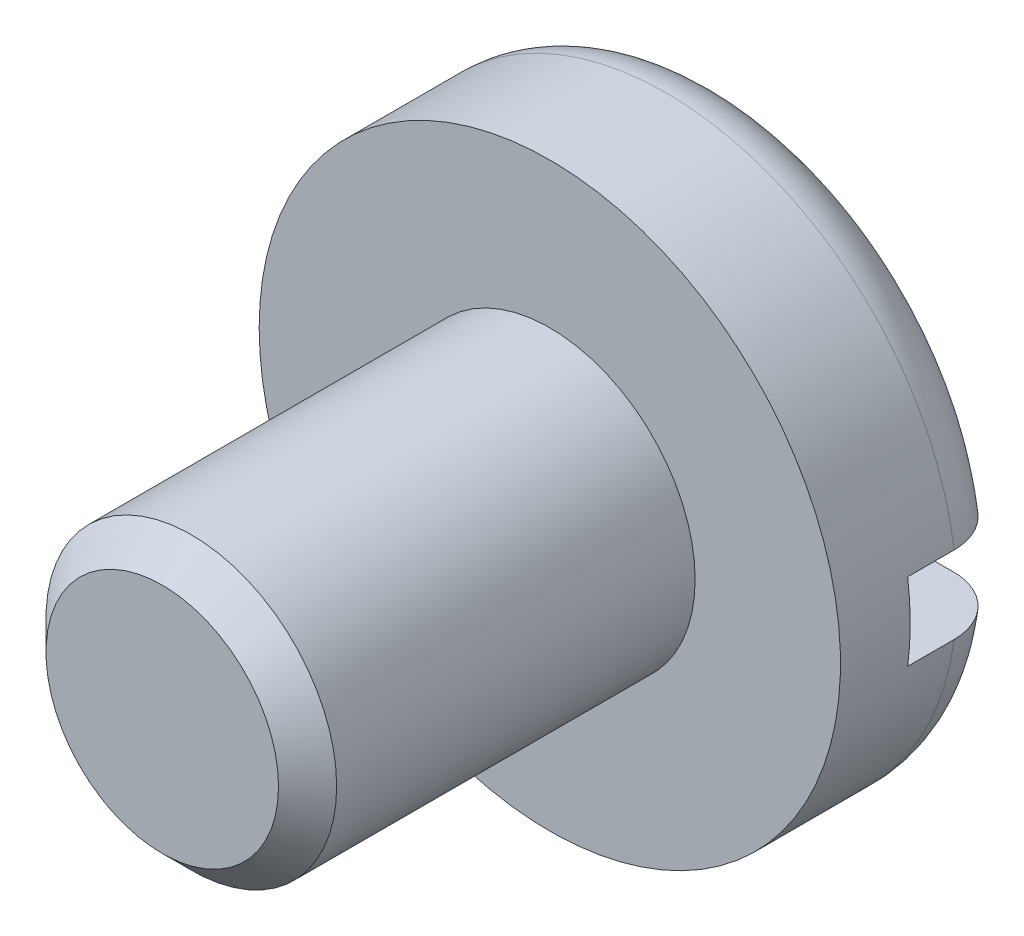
from build123d import *

# Parameters (mm, degrees)
ESQUISSE2_W             = 6
ESQUISSE2_H             = 0.8
ENLEV_MAT_EXTRU_1_DEPTH = 1.08
ESQUISSE3_W             = 1.5
ESQUISSE3_H             = 4
CHANFREIN1_SIZE         = 0.3


with BuildPart() as part:
    # Esquisse1 → Base-R_volution (revolve)
    with BuildSketch(Plane(origin=(0, 0, 0), x_dir=(1, 0, 0), z_dir=(0, 1, 0)), mode=Mode.PRIVATE) as base_r_volution_sk:
        with BuildLine():
            Line((0, 0), (3, 0))
            Line((3, 0), (3, 1.2))
            ThreePointArc((3, 1.2), (2.824264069, 1.624264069), (2.4, 1.8))
            Line((2.4, 1.8), (0, 1.8))
            Line((0, 1.8), (0, 0))
        make_face()
    revolve(base_r_volution_sk.sketch.rotate(Axis((0, 0, 0), (0, 0, -1)), 180), axis=Axis((0, 0, 0), (0, 0, -1)))

    # Esquisse2 → Enlev. mat.-Extru.1 (cut)
    with BuildSketch(Plane.XY.offset(-1.8)):
        Rectangle(ESQUISSE2_W, ESQUISSE2_H)
    extrude(amount=ENLEV_MAT_EXTRU_1_DEPTH, mode=Mode.SUBTRACT)

    # Esquisse3 → Boss.-R_vol.1 (revolve)
    with BuildSketch(Plane(origin=(0, 0, 0), x_dir=(1, 0, 0), z_dir=(0, 1, 0))):
        with Locations((0.75, -2)):
            Rectangle(ESQUISSE3_W, ESQUISSE3_H)
    revolve(axis=Axis((0, 0, 0), (0, 0, 1)))

    # Chanfrein1
    chanfrein1_edges = [part.edges().sort_by_distance(p)[0] for p in [
        (-1.5, 0, 4),
    ]]
    chamfer(chanfrein1_edges, length=CHANFREIN1_SIZE)


solid = part.part
